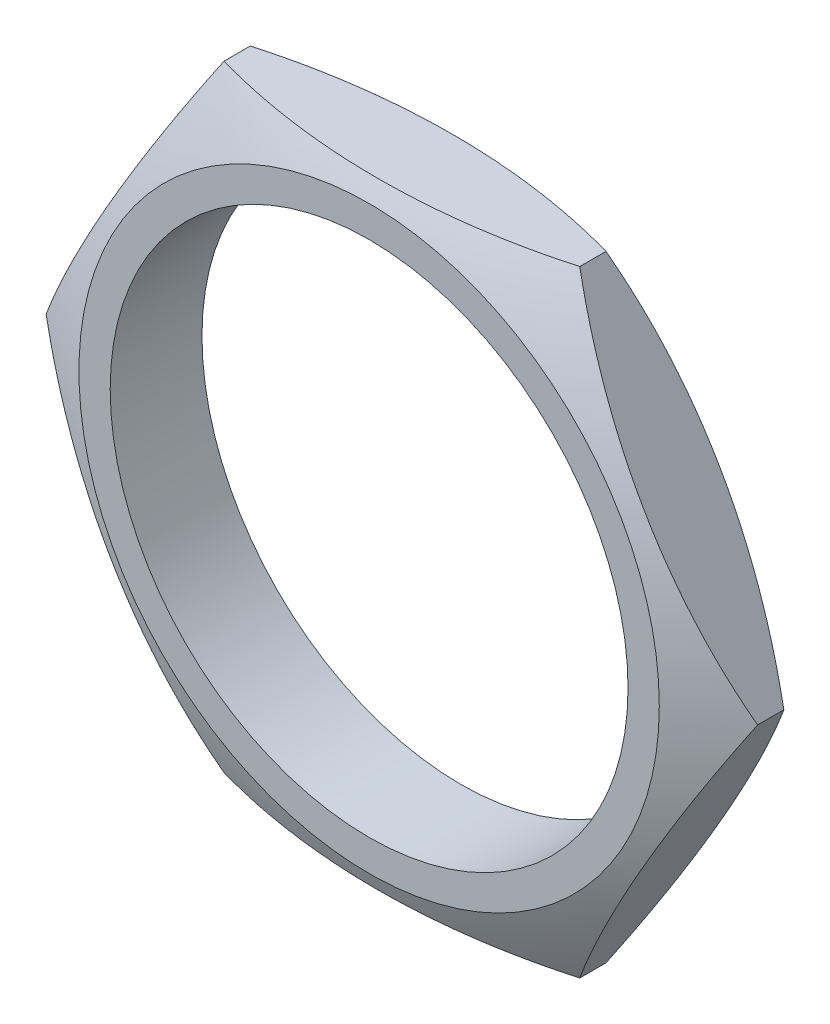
ISO-10303-21;
HEADER;
FILE_DESCRIPTION(('STEP AP214'),'2;1');
FILE_NAME('part.step','',(''),(''),'','','');
FILE_SCHEMA(('AUTOMOTIVE_DESIGN { 1 0 10303 214 1 1 1 1 }'));
ENDSEC;
DATA;
#1=APPLICATION_CONTEXT('core data for automotive mechanical design processes');
#2=APPLICATION_PROTOCOL_DEFINITION('international standard','automotive_design',2000,#1);
#3=PRODUCT_CONTEXT('',#1,'mechanical');
#4=PRODUCT('Part','Part','',(#3));
#5=PRODUCT_RELATED_PRODUCT_CATEGORY('part','',(#4));
#6=PRODUCT_DEFINITION_FORMATION('','',#4);
#7=PRODUCT_DEFINITION_CONTEXT('part definition',#1,'design');
#8=PRODUCT_DEFINITION('design','',#6,#7);
#9=PRODUCT_DEFINITION_SHAPE('','',#8);
#10=(LENGTH_UNIT() NAMED_UNIT(*) SI_UNIT(.MILLI.,.METRE.));
#11=(NAMED_UNIT(*) PLANE_ANGLE_UNIT() SI_UNIT($,.RADIAN.));
#12=(NAMED_UNIT(*) SI_UNIT($,.STERADIAN.) SOLID_ANGLE_UNIT());
#13=UNCERTAINTY_MEASURE_WITH_UNIT(LENGTH_MEASURE(1.E-05),#10,'distance_accuracy_value','');
#14=(GEOMETRIC_REPRESENTATION_CONTEXT(3) GLOBAL_UNCERTAINTY_ASSIGNED_CONTEXT((#13)) GLOBAL_UNIT_ASSIGNED_CONTEXT((#10,
#11,#12)) REPRESENTATION_CONTEXT('',''));
#15=CARTESIAN_POINT('',(0.,0.,0.));
#16=DIRECTION('',(0.,0.,1.));
#17=DIRECTION('',(1.,0.,0.));
#18=AXIS2_PLACEMENT_3D('',#15,#16,#17);
#19=CARTESIAN_POINT('',(5.42709253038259,-9.39999999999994,1.4));
#20=DIRECTION('',(-0.866025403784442,0.499999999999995,0.));
#21=DIRECTION('',(-0.499999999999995,-0.866025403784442,0.));
#22=AXIS2_PLACEMENT_3D('',#19,#20,#21);
#23=PLANE('',#22);
#24=CARTESIAN_POINT('',(8.14063879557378,-4.69999999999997,-18.8083701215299));
#25=DIRECTION('',(-0.866025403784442,0.499999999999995,0.));
#26=DIRECTION('',(-0.499999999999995,-0.866025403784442,0.));
#27=AXIS2_PLACEMENT_3D('',#24,#25,#26);
#28=CIRCLE('',#27,19.9603310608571);
#29=CARTESIAN_POINT('',(5.4270925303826,-9.39999999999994,0.400000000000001));
#30=VERTEX_POINT('',#29);
#31=CARTESIAN_POINT('',(10.854185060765,0.,0.400000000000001));
#32=VERTEX_POINT('',#31);
#33=EDGE_CURVE('E84',#30,#32,#28,.T.);
#34=ORIENTED_EDGE('',*,*,#33,.F.);
#35=DIRECTION('',(0.,0.,-1.));
#36=VECTOR('',#35,1.);
#37=CARTESIAN_POINT('',(5.42709253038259,-9.39999999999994,1.4));
#38=LINE('',#37,#36);
#39=CARTESIAN_POINT('',(5.42709253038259,-9.39999999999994,-0.400000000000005));
#40=VERTEX_POINT('',#39);
#41=EDGE_CURVE('E55',#30,#40,#38,.T.);
#42=ORIENTED_EDGE('',*,*,#41,.T.);
#43=CARTESIAN_POINT('',(8.14063879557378,-4.69999999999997,18.8083701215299));
#44=DIRECTION('',(-0.866025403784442,0.499999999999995,0.));
#45=DIRECTION('',(-0.499999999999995,-0.866025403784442,0.));
#46=AXIS2_PLACEMENT_3D('',#43,#44,#45);
#47=CIRCLE('',#46,19.9603310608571);
#48=CARTESIAN_POINT('',(10.854185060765,0.,-0.400000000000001));
#49=VERTEX_POINT('',#48);
#50=EDGE_CURVE('E101',#49,#40,#47,.T.);
#51=ORIENTED_EDGE('',*,*,#50,.F.);
#52=DIRECTION('',(0.,0.,-1.));
#53=VECTOR('',#52,1.);
#54=CARTESIAN_POINT('',(10.854185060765,0.,1.4));
#55=LINE('',#54,#53);
#56=EDGE_CURVE('E40',#32,#49,#55,.T.);
#57=ORIENTED_EDGE('',*,*,#56,.F.);
#58=EDGE_LOOP('',(#34,#42,#51,#57));
#59=FACE_BOUND('',#58,.T.);
#60=ADVANCED_FACE('F33',(#59),#23,.F.);
#61=CARTESIAN_POINT('',(10.854185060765,0.,1.4));
#62=DIRECTION('',(-0.866025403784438,-0.500000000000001,0.));
#63=DIRECTION('',(0.500000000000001,-0.866025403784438,0.));
#64=AXIS2_PLACEMENT_3D('',#61,#62,#63);
#65=PLANE('',#64);
#66=CARTESIAN_POINT('',(8.14063879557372,4.70000000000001,-18.8083701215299));
#67=DIRECTION('',(-0.866025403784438,-0.500000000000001,0.));
#68=DIRECTION('',(0.500000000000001,-0.866025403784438,0.));
#69=AXIS2_PLACEMENT_3D('',#66,#67,#68);
#70=CIRCLE('',#69,19.9603310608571);
#71=CARTESIAN_POINT('',(5.42709253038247,9.40000000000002,0.400000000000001));
#72=VERTEX_POINT('',#71);
#73=EDGE_CURVE('E87',#32,#72,#70,.T.);
#74=ORIENTED_EDGE('',*,*,#73,.F.);
#75=ORIENTED_EDGE('',*,*,#56,.T.);
#76=CARTESIAN_POINT('',(8.14063879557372,4.70000000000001,18.8083701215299));
#77=DIRECTION('',(-0.866025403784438,-0.500000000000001,0.));
#78=DIRECTION('',(0.500000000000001,-0.866025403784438,0.));
#79=AXIS2_PLACEMENT_3D('',#76,#77,#78);
#80=CIRCLE('',#79,19.9603310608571);
#81=CARTESIAN_POINT('',(5.42709253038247,9.40000000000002,-0.400000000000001));
#82=VERTEX_POINT('',#81);
#83=EDGE_CURVE('E118',#82,#49,#80,.T.);
#84=ORIENTED_EDGE('',*,*,#83,.F.);
#85=DIRECTION('',(0.,0.,-1.));
#86=VECTOR('',#85,1.);
#87=CARTESIAN_POINT('',(5.42709253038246,9.40000000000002,1.4));
#88=LINE('',#87,#86);
#89=EDGE_CURVE('E98',#72,#82,#88,.T.);
#90=ORIENTED_EDGE('',*,*,#89,.F.);
#91=EDGE_LOOP('',(#74,#75,#84,#90));
#92=FACE_BOUND('',#91,.T.);
#93=ADVANCED_FACE('F95',(#92),#65,.F.);
#94=CARTESIAN_POINT('',(5.42709253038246,9.40000000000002,1.4));
#95=DIRECTION('',(0.,-1.,0.));
#96=DIRECTION('',(1.,0.,0.));
#97=AXIS2_PLACEMENT_3D('',#94,#95,#96);
#98=PLANE('',#97);
#99=CARTESIAN_POINT('',(0.,9.4,-18.8083701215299));
#100=DIRECTION('',(0.,-1.,0.));
#101=DIRECTION('',(1.,0.,0.));
#102=AXIS2_PLACEMENT_3D('',#99,#100,#101);
#103=CIRCLE('',#102,19.9603310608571);
#104=CARTESIAN_POINT('',(-5.42709253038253,9.39999999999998,0.400000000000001));
#105=VERTEX_POINT('',#104);
#106=EDGE_CURVE('E99',#72,#105,#103,.T.);
#107=ORIENTED_EDGE('',*,*,#106,.F.);
#108=ORIENTED_EDGE('',*,*,#89,.T.);
#109=CARTESIAN_POINT('',(0.,9.4,18.8083701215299));
#110=DIRECTION('',(0.,-1.,0.));
#111=DIRECTION('',(1.,0.,0.));
#112=AXIS2_PLACEMENT_3D('',#109,#110,#111);
#113=CIRCLE('',#112,19.9603310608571);
#114=CARTESIAN_POINT('',(-5.42709253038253,9.39999999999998,-0.400000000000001));
#115=VERTEX_POINT('',#114);
#116=EDGE_CURVE('E120',#115,#82,#113,.T.);
#117=ORIENTED_EDGE('',*,*,#116,.F.);
#118=DIRECTION('',(0.,0.,-1.));
#119=VECTOR('',#118,1.);
#120=CARTESIAN_POINT('',(-5.42709253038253,9.39999999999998,1.4));
#121=LINE('',#120,#119);
#122=EDGE_CURVE('E102',#105,#115,#121,.T.);
#123=ORIENTED_EDGE('',*,*,#122,.F.);
#124=EDGE_LOOP('',(#107,#108,#117,#123));
#125=FACE_BOUND('',#124,.T.);
#126=ADVANCED_FACE('F155',(#125),#98,.F.);
#127=CARTESIAN_POINT('',(-5.42709253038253,9.39999999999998,1.4));
#128=DIRECTION('',(0.866025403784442,-0.499999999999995,0.));
#129=DIRECTION('',(0.499999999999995,0.866025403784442,0.));
#130=AXIS2_PLACEMENT_3D('',#127,#128,#129);
#131=PLANE('',#130);
#132=CARTESIAN_POINT('',(-8.14063879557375,4.69999999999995,-18.8083701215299));
#133=DIRECTION('',(0.866025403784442,-0.499999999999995,0.));
#134=DIRECTION('',(0.499999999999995,0.866025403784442,0.));
#135=AXIS2_PLACEMENT_3D('',#132,#133,#134);
#136=CIRCLE('',#135,19.9603310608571);
#137=CARTESIAN_POINT('',(-10.854185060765,0.,0.400000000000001));
#138=VERTEX_POINT('',#137);
#139=EDGE_CURVE('E132',#105,#138,#136,.T.);
#140=ORIENTED_EDGE('',*,*,#139,.F.);
#141=ORIENTED_EDGE('',*,*,#122,.T.);
#142=CARTESIAN_POINT('',(-8.14063879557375,4.69999999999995,18.8083701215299));
#143=DIRECTION('',(0.866025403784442,-0.499999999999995,0.));
#144=DIRECTION('',(0.499999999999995,0.866025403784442,0.));
#145=AXIS2_PLACEMENT_3D('',#142,#143,#144);
#146=CIRCLE('',#145,19.9603310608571);
#147=CARTESIAN_POINT('',(-10.854185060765,0.,-0.400000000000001));
#148=VERTEX_POINT('',#147);
#149=EDGE_CURVE('E123',#148,#115,#146,.T.);
#150=ORIENTED_EDGE('',*,*,#149,.F.);
#151=DIRECTION('',(0.,0.,-1.));
#152=VECTOR('',#151,1.);
#153=CARTESIAN_POINT('',(-10.854185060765,0.,1.4));
#154=LINE('',#153,#152);
#155=EDGE_CURVE('E106',#138,#148,#154,.T.);
#156=ORIENTED_EDGE('',*,*,#155,.F.);
#157=EDGE_LOOP('',(#140,#141,#150,#156));
#158=FACE_BOUND('',#157,.T.);
#159=ADVANCED_FACE('F159',(#158),#131,.F.);
#160=CARTESIAN_POINT('',(-10.854185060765,0.,1.4));
#161=DIRECTION('',(0.866025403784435,0.500000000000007,0.));
#162=DIRECTION('',(-0.500000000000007,0.866025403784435,0.));
#163=AXIS2_PLACEMENT_3D('',#160,#161,#162);
#164=PLANE('',#163);
#165=CARTESIAN_POINT('',(-8.14063879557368,-4.70000000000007,-18.8083701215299));
#166=DIRECTION('',(0.866025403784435,0.500000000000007,0.));
#167=DIRECTION('',(-0.500000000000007,0.866025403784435,0.));
#168=AXIS2_PLACEMENT_3D('',#165,#166,#167);
#169=CIRCLE('',#168,19.9603310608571);
#170=CARTESIAN_POINT('',(-5.4270925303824,-9.40000000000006,0.400000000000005));
#171=VERTEX_POINT('',#170);
#172=EDGE_CURVE('E47',#138,#171,#169,.T.);
#173=ORIENTED_EDGE('',*,*,#172,.F.);
#174=ORIENTED_EDGE('',*,*,#155,.T.);
#175=CARTESIAN_POINT('',(-8.14063879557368,-4.70000000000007,18.8083701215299));
#176=DIRECTION('',(0.866025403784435,0.500000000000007,0.));
#177=DIRECTION('',(-0.500000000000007,0.866025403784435,0.));
#178=AXIS2_PLACEMENT_3D('',#175,#176,#177);
#179=CIRCLE('',#178,19.9603310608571);
#180=CARTESIAN_POINT('',(-5.4270925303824,-9.40000000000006,-0.400000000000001));
#181=VERTEX_POINT('',#180);
#182=EDGE_CURVE('E126',#181,#148,#179,.T.);
#183=ORIENTED_EDGE('',*,*,#182,.F.);
#184=DIRECTION('',(0.,0.,-1.));
#185=VECTOR('',#184,1.);
#186=CARTESIAN_POINT('',(-5.4270925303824,-9.40000000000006,1.4));
#187=LINE('',#186,#185);
#188=EDGE_CURVE('E108',#171,#181,#187,.T.);
#189=ORIENTED_EDGE('',*,*,#188,.F.);
#190=EDGE_LOOP('',(#173,#174,#183,#189));
#191=FACE_BOUND('',#190,.T.);
#192=ADVANCED_FACE('F165',(#191),#164,.F.);
#193=CARTESIAN_POINT('',(-5.4270925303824,-9.40000000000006,1.4));
#194=DIRECTION('',(0.,1.,0.));
#195=DIRECTION('',(-1.,0.,0.));
#196=AXIS2_PLACEMENT_3D('',#193,#194,#195);
#197=PLANE('',#196);
#198=CARTESIAN_POINT('',(0.,-9.4,-18.8083701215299));
#199=DIRECTION('',(0.,1.,0.));
#200=DIRECTION('',(-1.,0.,0.));
#201=AXIS2_PLACEMENT_3D('',#198,#199,#200);
#202=CIRCLE('',#201,19.9603310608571);
#203=EDGE_CURVE('E89',#171,#30,#202,.T.);
#204=ORIENTED_EDGE('',*,*,#203,.F.);
#205=ORIENTED_EDGE('',*,*,#188,.T.);
#206=CARTESIAN_POINT('',(0.,-9.4,18.8083701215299));
#207=DIRECTION('',(0.,1.,0.));
#208=DIRECTION('',(-1.,0.,0.));
#209=AXIS2_PLACEMENT_3D('',#206,#207,#208);
#210=CIRCLE('',#209,19.9603310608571);
#211=EDGE_CURVE('E11',#40,#181,#210,.T.);
#212=ORIENTED_EDGE('',*,*,#211,.F.);
#213=ORIENTED_EDGE('',*,*,#41,.F.);
#214=EDGE_LOOP('',(#204,#205,#212,#213));
#215=FACE_BOUND('',#214,.T.);
#216=ADVANCED_FACE('F169',(#215),#197,.F.);
#217=CARTESIAN_POINT('',(0.,0.,1.4));
#218=DIRECTION('',(0.,0.,1.));
#219=DIRECTION('',(1.,0.,0.));
#220=AXIS2_PLACEMENT_3D('',#217,#218,#219);
#221=PLANE('',#220);
#222=CARTESIAN_POINT('',(0.,0.,1.4));
#223=DIRECTION('',(0.,0.,1.));
#224=DIRECTION('',(1.,0.,0.));
#225=AXIS2_PLACEMENT_3D('',#222,#223,#224);
#226=CIRCLE('',#225,7.9);
#227=CARTESIAN_POINT('',(7.9,0.,1.4));
#228=VERTEX_POINT('',#227);
#229=EDGE_CURVE('E111',#228,#228,#226,.T.);
#230=ORIENTED_EDGE('',*,*,#229,.F.);
#231=EDGE_LOOP('',(#230));
#232=FACE_BOUND('',#231,.T.);
#233=CARTESIAN_POINT('',(0.,0.,1.4));
#234=DIRECTION('',(0.,0.,1.));
#235=DIRECTION('',(1.,0.,0.));
#236=AXIS2_PLACEMENT_3D('',#233,#234,#235);
#237=CIRCLE('',#236,8.85418506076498);
#238=CARTESIAN_POINT('',(8.85418506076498,0.,1.4));
#239=VERTEX_POINT('',#238);
#240=EDGE_CURVE('E136',#239,#239,#237,.T.);
#241=ORIENTED_EDGE('',*,*,#240,.T.);
#242=EDGE_LOOP('',(#241));
#243=FACE_BOUND('',#242,.T.);
#244=ADVANCED_FACE('F140',(#232,#243),#221,.T.);
#245=CARTESIAN_POINT('',(0.,0.,-1.4));
#246=DIRECTION('',(0.,0.,1.));
#247=DIRECTION('',(1.,0.,0.));
#248=AXIS2_PLACEMENT_3D('',#245,#246,#247);
#249=PLANE('',#248);
#250=CARTESIAN_POINT('',(0.,0.,-1.4));
#251=DIRECTION('',(0.,0.,1.));
#252=DIRECTION('',(1.,0.,0.));
#253=AXIS2_PLACEMENT_3D('',#250,#251,#252);
#254=CIRCLE('',#253,7.9);
#255=CARTESIAN_POINT('',(7.9,0.,-1.4));
#256=VERTEX_POINT('',#255);
#257=EDGE_CURVE('E112',#256,#256,#254,.T.);
#258=ORIENTED_EDGE('',*,*,#257,.T.);
#259=EDGE_LOOP('',(#258));
#260=FACE_BOUND('',#259,.T.);
#261=CARTESIAN_POINT('',(0.,0.,-1.4));
#262=DIRECTION('',(0.,0.,1.));
#263=DIRECTION('',(1.,0.,0.));
#264=AXIS2_PLACEMENT_3D('',#261,#262,#263);
#265=CIRCLE('',#264,8.85418506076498);
#266=CARTESIAN_POINT('',(8.85418506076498,0.,-1.4));
#267=VERTEX_POINT('',#266);
#268=EDGE_CURVE('E91',#267,#267,#265,.T.);
#269=ORIENTED_EDGE('',*,*,#268,.F.);
#270=EDGE_LOOP('',(#269));
#271=FACE_BOUND('',#270,.T.);
#272=ADVANCED_FACE('F174',(#260,#271),#249,.F.);
#273=CARTESIAN_POINT('',(0.,0.,1.4));
#274=DIRECTION('',(0.,0.,-1.));
#275=DIRECTION('',(-1.,0.,0.));
#276=AXIS2_PLACEMENT_3D('',#273,#274,#275);
#277=CYLINDRICAL_SURFACE('',#276,7.9);
#278=ORIENTED_EDGE('',*,*,#229,.T.);
#279=EDGE_LOOP('',(#278));
#280=FACE_BOUND('',#279,.T.);
#281=ORIENTED_EDGE('',*,*,#257,.F.);
#282=EDGE_LOOP('',(#281));
#283=FACE_BOUND('',#282,.T.);
#284=ADVANCED_FACE('F148',(#280,#283),#277,.F.);
#285=CARTESIAN_POINT('',(0.,0.,18.8083701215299));
#286=DIRECTION('',(0.,0.,1.));
#287=DIRECTION('',(-1.,0.,0.));
#288=AXIS2_PLACEMENT_3D('',#285,#286,#287);
#289=SPHERICAL_SURFACE('',#288,22.0629738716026);
#290=ORIENTED_EDGE('',*,*,#268,.T.);
#291=EDGE_LOOP('',(#290));
#292=FACE_BOUND('',#291,.T.);
#293=ORIENTED_EDGE('',*,*,#50,.T.);
#294=ORIENTED_EDGE('',*,*,#211,.T.);
#295=ORIENTED_EDGE('',*,*,#182,.T.);
#296=ORIENTED_EDGE('',*,*,#149,.T.);
#297=ORIENTED_EDGE('',*,*,#116,.T.);
#298=ORIENTED_EDGE('',*,*,#83,.T.);
#299=EDGE_LOOP('',(#293,#294,#295,#296,#297,#298));
#300=FACE_BOUND('',#299,.T.);
#301=ADVANCED_FACE('F143',(#292,#300),#289,.T.);
#302=CARTESIAN_POINT('',(0.,0.,-18.8083701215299));
#303=DIRECTION('',(0.,0.,-1.));
#304=DIRECTION('',(-1.,0.,0.));
#305=AXIS2_PLACEMENT_3D('',#302,#303,#304);
#306=SPHERICAL_SURFACE('',#305,22.0629738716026);
#307=ORIENTED_EDGE('',*,*,#240,.F.);
#308=EDGE_LOOP('',(#307));
#309=FACE_BOUND('',#308,.T.);
#310=ORIENTED_EDGE('',*,*,#33,.T.);
#311=ORIENTED_EDGE('',*,*,#73,.T.);
#312=ORIENTED_EDGE('',*,*,#106,.T.);
#313=ORIENTED_EDGE('',*,*,#139,.T.);
#314=ORIENTED_EDGE('',*,*,#172,.T.);
#315=ORIENTED_EDGE('',*,*,#203,.T.);
#316=EDGE_LOOP('',(#310,#311,#312,#313,#314,#315));
#317=FACE_BOUND('',#316,.T.);
#318=ADVANCED_FACE('F86',(#309,#317),#306,.T.);
#319=CLOSED_SHELL('',(#60,#93,#126,#159,#192,#216,#244,#272,#284,#301,#318));
#320=MANIFOLD_SOLID_BREP('B2',#319);
#321=ADVANCED_BREP_SHAPE_REPRESENTATION('',(#18,#320),#14);
#322=SHAPE_DEFINITION_REPRESENTATION(#9,#321);
ENDSEC;
END-ISO-10303-21;
